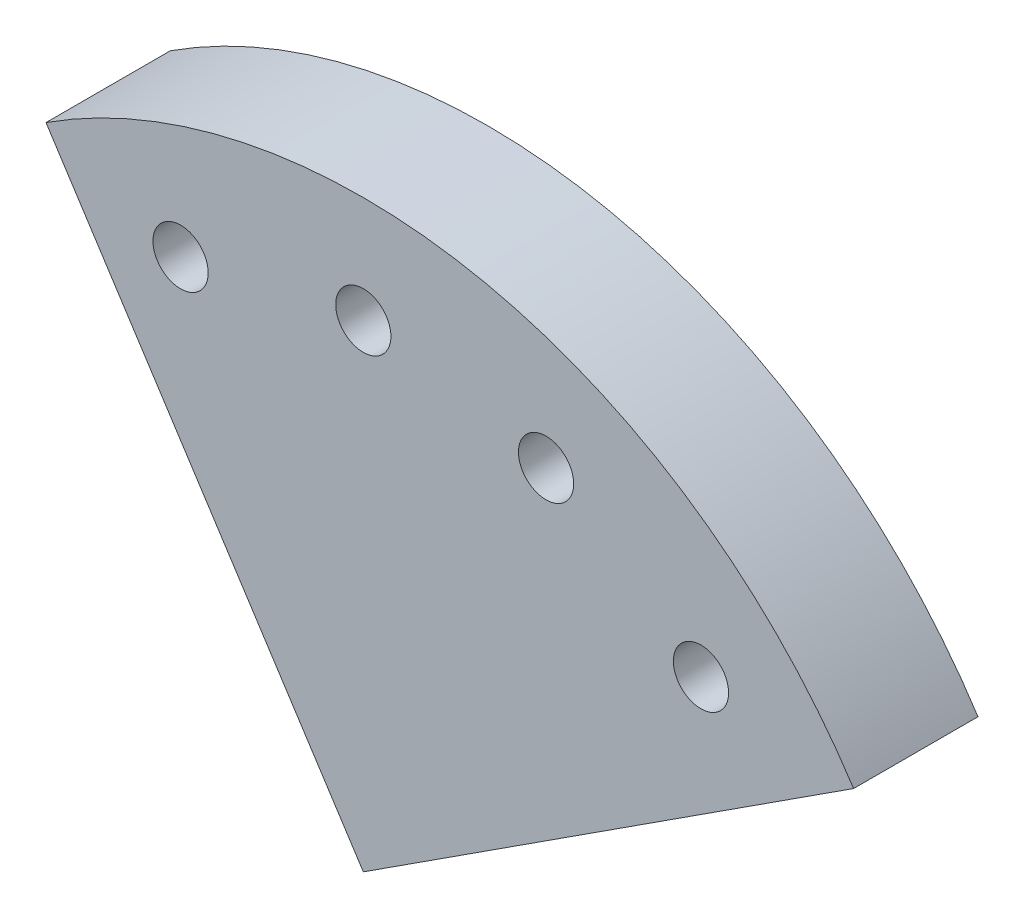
from build123d import *

# Parameters (mm, degrees)
SKETCH1_R         = 24.4475
EXTRUDE1_DEPTH    = 5.207
SKETCH2_R         = 1.1557
EXTRUDE2_DEPTH    = 35.963886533
CIRPATTERN3_COUNT = 16
EXTRUDE3_DEPTH    = 35.963886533


with BuildPart() as part:
    # Sketch1 → Extrude1 (new body)
    with BuildSketch(Plane.XY):
        Circle(SKETCH1_R)
    extrude(amount=EXTRUDE1_DEPTH)

    # Sketch2 → Extrude2 (cut, through all)
    with BuildSketch(Plane.XY.offset(5.207)):
        with Locations((0, 19.9898)):
            Circle(SKETCH2_R)
    extrude2 = extrude(amount=-EXTRUDE2_DEPTH, mode=Mode.SUBTRACT)

    # CirPattern3: Extrude2 ×16 about axis
    cirpattern3_axis = Axis((0, 0, 0), (0, 0, 1))
    for i in range(1, CIRPATTERN3_COUNT):
        add(extrude2.rotate(cirpattern3_axis, i * 360 / CIRPATTERN3_COUNT), mode=Mode.SUBTRACT)

    # Sketch3 → Extrude3 (cut, through all)
    with BuildSketch(Plane.XY.offset(5.207)):
        with BuildLine():
            Line((0, 0), (23.257369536, 15.051461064))
            ThreePointArc((23.257369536, 15.051461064), (-5.802453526, -27.088433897), (-15.051461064, 23.257369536))
            Line((-15.051461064, 23.257369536), (0, 0))
        make_face()
    extrude(amount=-EXTRUDE3_DEPTH, mode=Mode.SUBTRACT)


solid = part.part
